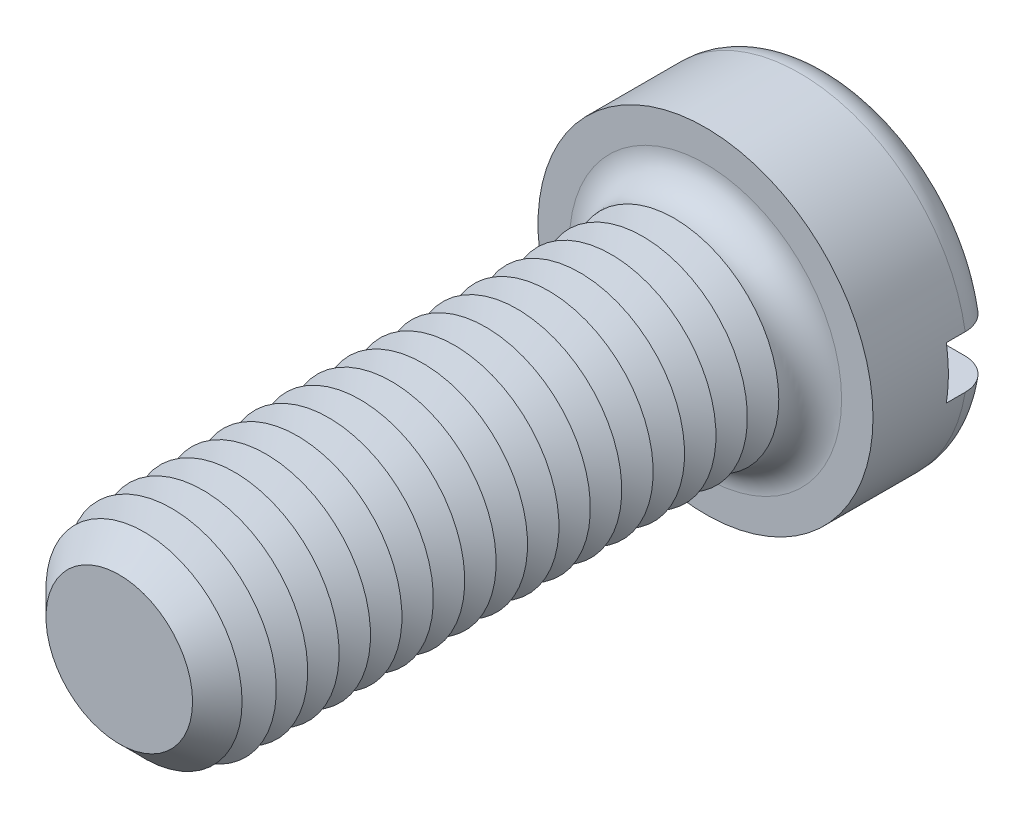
ISO-10303-21;
HEADER;
FILE_DESCRIPTION(('STEP AP214'),'2;1');
FILE_NAME('part.step','',(''),(''),'','','');
FILE_SCHEMA(('AUTOMOTIVE_DESIGN { 1 0 10303 214 1 1 1 1 }'));
ENDSEC;
DATA;
#1=APPLICATION_CONTEXT('core data for automotive mechanical design processes');
#2=APPLICATION_PROTOCOL_DEFINITION('international standard','automotive_design',2000,#1);
#3=PRODUCT_CONTEXT('',#1,'mechanical');
#4=PRODUCT('Part','Part','',(#3));
#5=PRODUCT_RELATED_PRODUCT_CATEGORY('part','',(#4));
#6=PRODUCT_DEFINITION_FORMATION('','',#4);
#7=PRODUCT_DEFINITION_CONTEXT('part definition',#1,'design');
#8=PRODUCT_DEFINITION('design','',#6,#7);
#9=PRODUCT_DEFINITION_SHAPE('','',#8);
#10=(LENGTH_UNIT() NAMED_UNIT(*) SI_UNIT(.MILLI.,.METRE.));
#11=(NAMED_UNIT(*) PLANE_ANGLE_UNIT() SI_UNIT($,.RADIAN.));
#12=(NAMED_UNIT(*) SI_UNIT($,.STERADIAN.) SOLID_ANGLE_UNIT());
#13=UNCERTAINTY_MEASURE_WITH_UNIT(LENGTH_MEASURE(1.E-05),#10,'distance_accuracy_value','');
#14=(GEOMETRIC_REPRESENTATION_CONTEXT(3) GLOBAL_UNCERTAINTY_ASSIGNED_CONTEXT((#13)) GLOBAL_UNIT_ASSIGNED_CONTEXT((#10,
#11,#12)) REPRESENTATION_CONTEXT('',''));
#15=CARTESIAN_POINT('',(0.,0.,0.));
#16=DIRECTION('',(0.,0.,1.));
#17=DIRECTION('',(1.,0.,0.));
#18=AXIS2_PLACEMENT_3D('',#15,#16,#17);
#19=CARTESIAN_POINT('',(0.,0.,-6.));
#20=DIRECTION('',(0.,0.,1.));
#21=DIRECTION('',(1.,0.,0.));
#22=AXIS2_PLACEMENT_3D('',#19,#20,#21);
#23=PLANE('',#22);
#24=CARTESIAN_POINT('',(0.,0.,-6.));
#25=DIRECTION('',(0.,0.,1.));
#26=DIRECTION('',(1.,0.,0.));
#27=AXIS2_PLACEMENT_3D('',#24,#25,#26);
#28=CIRCLE('',#27,6.5);
#29=CARTESIAN_POINT('',(-6.37867541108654,1.25,-6.));
#30=VERTEX_POINT('',#29);
#31=CARTESIAN_POINT('',(6.37867541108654,1.25,-6.));
#32=VERTEX_POINT('',#31);
#33=EDGE_CURVE('E116',#30,#32,#28,.F.);
#34=ORIENTED_EDGE('',*,*,#33,.T.);
#35=DIRECTION('',(1.,0.,0.));
#36=VECTOR('',#35,1.);
#37=CARTESIAN_POINT('',(-8.,1.25,-6.));
#38=LINE('',#37,#36);
#39=EDGE_CURVE('E111',#30,#32,#38,.T.);
#40=ORIENTED_EDGE('',*,*,#39,.F.);
#41=EDGE_LOOP('',(#34,#40));
#42=FACE_BOUND('',#41,.T.);
#43=ADVANCED_FACE('F39',(#42),#23,.F.);
#44=CARTESIAN_POINT('',(0.,0.,-4.5));
#45=DIRECTION('',(0.,0.,1.));
#46=DIRECTION('',(1.,0.,0.));
#47=AXIS2_PLACEMENT_3D('',#44,#45,#46);
#48=TOROIDAL_SURFACE('',#47,6.5,1.5);
#49=CARTESIAN_POINT('',(-7.63778128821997,1.25,-5.34492908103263));
#50=CARTESIAN_POINT('',(-7.58949199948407,1.25,-5.41482553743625));
#51=CARTESIAN_POINT('',(-7.53520056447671,1.25,-5.48065698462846));
#52=CARTESIAN_POINT('',(-7.41624971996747,1.25,-5.60228223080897));
#53=CARTESIAN_POINT('',(-7.35157642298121,1.25,-5.65806236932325));
#54=CARTESIAN_POINT('',(-7.21387612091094,1.25,-5.75795436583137));
#55=CARTESIAN_POINT('',(-7.14085828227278,1.25,-5.80207885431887));
#56=CARTESIAN_POINT('',(-6.98853766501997,1.25,-5.87758013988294));
#57=CARTESIAN_POINT('',(-6.90923642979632,1.25,-5.90896005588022));
#58=CARTESIAN_POINT('',(-6.74565677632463,1.25,-5.95849861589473));
#59=CARTESIAN_POINT('',(-6.66133328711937,1.25,-5.97650838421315));
#60=CARTESIAN_POINT('',(-6.49086565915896,1.25,-5.99833509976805));
#61=CARTESIAN_POINT('',(-6.40472129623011,1.25,-6.00215028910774));
#62=CARTESIAN_POINT('',(-6.23174891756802,1.25,-5.99550457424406));
#63=CARTESIAN_POINT('',(-6.14492874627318,1.25,-5.98483870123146));
#64=CARTESIAN_POINT('',(-5.97427268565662,1.25,-5.94920077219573));
#65=CARTESIAN_POINT('',(-5.89043699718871,1.25,-5.92422775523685));
#66=CARTESIAN_POINT('',(-5.72747580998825,1.25,-5.86041051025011));
#67=CARTESIAN_POINT('',(-5.64839123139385,1.25,-5.8214616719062));
#68=CARTESIAN_POINT('',(-5.49793182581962,1.25,-5.73076137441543));
#69=CARTESIAN_POINT('',(-5.42655700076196,1.25,-5.6790099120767));
#70=CARTESIAN_POINT('',(-5.29410028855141,1.25,-5.56444713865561));
#71=CARTESIAN_POINT('',(-5.23295591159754,1.25,-5.50170815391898));
#72=CARTESIAN_POINT('',(-5.12236155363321,1.25,-5.36664720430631));
#73=CARTESIAN_POINT('',(-5.07291010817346,1.25,-5.29432644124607));
#74=CARTESIAN_POINT('',(-4.98836421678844,1.25,-5.14389152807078));
#75=CARTESIAN_POINT('',(-4.95296843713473,1.25,-5.0659468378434));
#76=CARTESIAN_POINT('',(-4.89620356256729,1.25,-4.90510804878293));
#77=CARTESIAN_POINT('',(-4.87483169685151,1.25,-4.82221493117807));
#78=CARTESIAN_POINT('',(-4.8472995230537,1.25,-4.65636387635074));
#79=CARTESIAN_POINT('',(-4.84072446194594,1.25,-4.57347463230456));
#80=CARTESIAN_POINT('',(-4.84179430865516,1.25,-4.40779255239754));
#81=CARTESIAN_POINT('',(-4.84943782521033,1.25,-4.32499970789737));
#82=CARTESIAN_POINT('',(-4.87846819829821,1.25,-4.16301415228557));
#83=CARTESIAN_POINT('',(-4.89966978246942,1.25,-4.08378809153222));
#84=CARTESIAN_POINT('',(-4.95491528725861,1.25,-3.92995334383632));
#85=CARTESIAN_POINT('',(-4.98895983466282,1.25,-3.85534488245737));
#86=CARTESIAN_POINT('',(-5.06928242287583,1.25,-3.71183790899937));
#87=CARTESIAN_POINT('',(-5.11570495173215,1.25,-3.64302036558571));
#88=CARTESIAN_POINT('',(-5.21915370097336,1.25,-3.51388372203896));
#89=CARTESIAN_POINT('',(-5.27618132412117,1.25,-3.45356574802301));
#90=CARTESIAN_POINT('',(-5.40090076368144,1.25,-3.34137671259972));
#91=CARTESIAN_POINT('',(-5.46884305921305,1.25,-3.28978408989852));
#92=CARTESIAN_POINT('',(-5.61225757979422,1.25,-3.19841811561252));
#93=CARTESIAN_POINT('',(-5.68773079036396,1.25,-3.15864631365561));
#94=CARTESIAN_POINT('',(-5.84602026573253,1.25,-3.09111626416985));
#95=CARTESIAN_POINT('',(-5.92896901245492,1.25,-3.06366820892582));
#96=CARTESIAN_POINT('',(-6.09827849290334,1.25,-3.02294686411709));
#97=CARTESIAN_POINT('',(-6.18463944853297,1.25,-3.00967449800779));
#98=CARTESIAN_POINT('',(-6.35914138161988,1.25,-2.99765063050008));
#99=CARTESIAN_POINT('',(-6.4472913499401,1.25,-2.99902877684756));
#100=CARTESIAN_POINT('',(-6.62209547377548,1.25,-3.01665363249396));
#101=CARTESIAN_POINT('',(-6.70874965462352,1.25,-3.03290008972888));
#102=CARTESIAN_POINT('',(-6.87754008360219,1.25,-3.07975247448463));
#103=CARTESIAN_POINT('',(-6.95969991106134,1.25,-3.11027336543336));
#104=CARTESIAN_POINT('',(-7.11762200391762,1.25,-3.18486653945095));
#105=CARTESIAN_POINT('',(-7.19338469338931,1.25,-3.22893792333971));
#106=CARTESIAN_POINT('',(-7.33522754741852,1.25,-3.32873457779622));
#107=CARTESIAN_POINT('',(-7.40142768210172,1.25,-3.38428930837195));
#108=CARTESIAN_POINT('',(-7.52338344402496,1.25,-3.50587739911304));
#109=CARTESIAN_POINT('',(-7.5791399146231,1.25,-3.57190991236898));
#110=CARTESIAN_POINT('',(-7.67774856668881,1.25,-3.71151097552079));
#111=CARTESIAN_POINT('',(-7.72078137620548,1.25,-3.7849519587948));
#112=CARTESIAN_POINT('',(-7.79373860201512,1.25,-3.93807617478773));
#113=CARTESIAN_POINT('',(-7.82366445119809,1.25,-4.01775872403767));
#114=CARTESIAN_POINT('',(-7.86922494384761,1.25,-4.1801114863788));
#115=CARTESIAN_POINT('',(-7.88502105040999,1.25,-4.26273642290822));
#116=CARTESIAN_POINT('',(-7.90243332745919,1.25,-4.42948977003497));
#117=CARTESIAN_POINT('',(-7.90404643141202,1.25,-4.51361850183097));
#118=CARTESIAN_POINT('',(-7.89306914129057,1.25,-4.68049925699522));
#119=CARTESIAN_POINT('',(-7.88055163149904,1.25,-4.76325613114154));
#120=CARTESIAN_POINT('',(-7.84181179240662,1.25,-4.92542124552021));
#121=CARTESIAN_POINT('',(-7.81560657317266,1.25,-5.00483353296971));
#122=CARTESIAN_POINT('',(-7.76329893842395,1.25,-5.12766777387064));
#123=CARTESIAN_POINT('',(-7.74127773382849,1.25,-5.17287245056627));
#124=CARTESIAN_POINT('',(-7.69279783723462,1.25,-5.26083500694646));
#125=CARTESIAN_POINT('',(-7.66633917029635,1.25,-5.30359290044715));
#126=CARTESIAN_POINT('',(-7.63778128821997,1.25,-5.34492908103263));
#127=B_SPLINE_CURVE_WITH_KNOTS('',3,(#49,#50,#51,#52,#53,#54,#55,#56,#57,#58,#59,#60,#61,#62,
#63,#64,#65,#66,#67,#68,#69,#70,#71,#72,#73,#74,#75,#76,#77,#78,#79,#80,#81,#82,#83,#84,#85,#86,
#87,#88,#89,#90,#91,#92,#93,#94,#95,#96,#97,#98,#99,#100,#101,#102,#103,#104,#105,#106,#107,
#108,#109,#110,#111,#112,#113,#114,#115,#116,#117,#118,#119,#120,#121,#122,#123,#124,#125,#126),
.UNSPECIFIED.,.T.,.F.,(4,2,2,2,2,2,2,2,2,2,2,2,2,2,2,2,2,2,2,2,2,2,2,2,2,2,2,2,2,2,2,2,2,2,2,2,
2,2,4),(0.,0.254678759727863,0.509701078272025,0.764445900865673,1.01912834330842,
1.27660578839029,1.53411511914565,1.7953075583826,2.05651754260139,2.31972495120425,
2.58293242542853,2.84446831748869,3.10597143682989,3.36151874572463,3.61701554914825,
3.86525656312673,4.11347328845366,4.35836855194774,4.60327576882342,4.8511774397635,
5.0991119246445,5.35387584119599,5.60867314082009,5.86956650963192,6.13047687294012,
6.39369803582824,6.65691473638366,6.91858297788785,7.18023385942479,7.43824706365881,
7.69623942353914,7.95037087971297,8.20447454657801,8.45563599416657,8.70685174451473,
8.95677764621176,9.20639187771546,9.35700761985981,9.50762251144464),.UNSPECIFIED.);
#128=CARTESIAN_POINT('',(-7.90174031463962,1.25,-4.50000000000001));
#129=VERTEX_POINT('',#128);
#130=EDGE_CURVE('E321',#129,#30,#127,.T.);
#131=ORIENTED_EDGE('',*,*,#130,.F.);
#132=CARTESIAN_POINT('',(0.,0.,-4.5));
#133=DIRECTION('',(0.,0.,1.));
#134=DIRECTION('',(1.,0.,0.));
#135=AXIS2_PLACEMENT_3D('',#132,#133,#134);
#136=CIRCLE('',#135,8.);
#137=CARTESIAN_POINT('',(7.90174031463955,1.25,-4.5));
#138=VERTEX_POINT('',#137);
#139=EDGE_CURVE('E125',#138,#129,#136,.T.);
#140=ORIENTED_EDGE('',*,*,#139,.F.);
#141=CARTESIAN_POINT('',(4.95236709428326,1.25,-5.05808354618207));
#142=CARTESIAN_POINT('',(4.98477386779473,1.25,-5.13646278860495));
#143=CARTESIAN_POINT('',(5.02397623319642,1.25,-5.21210974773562));
#144=CARTESIAN_POINT('',(5.11464829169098,1.25,-5.35575180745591));
#145=CARTESIAN_POINT('',(5.16613670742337,1.25,-5.42373499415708));
#146=CARTESIAN_POINT('',(5.27963080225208,1.25,-5.55005899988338));
#147=CARTESIAN_POINT('',(5.34161871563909,1.25,-5.60841578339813));
#148=CARTESIAN_POINT('',(5.47431803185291,1.25,-5.71412381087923));
#149=CARTESIAN_POINT('',(5.545027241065,1.25,-5.76147781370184));
#150=CARTESIAN_POINT('',(5.69469818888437,1.25,-5.84486022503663));
#151=CARTESIAN_POINT('',(5.77379661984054,1.25,-5.88064336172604));
#152=CARTESIAN_POINT('',(5.93682776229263,1.25,-5.93863952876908));
#153=CARTESIAN_POINT('',(6.02076112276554,1.25,-5.96085073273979));
#154=CARTESIAN_POINT('',(6.19235911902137,1.25,-5.99130732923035));
#155=CARTESIAN_POINT('',(6.2800597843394,1.25,-5.99935025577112));
#156=CARTESIAN_POINT('',(6.45556807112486,1.25,-6.00057400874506));
#157=CARTESIAN_POINT('',(6.54337569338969,1.25,-5.99375472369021));
#158=CARTESIAN_POINT('',(6.71642471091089,1.25,-5.96539034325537));
#159=CARTESIAN_POINT('',(6.8016703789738,1.25,-5.94387137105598));
#160=CARTESIAN_POINT('',(6.96726399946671,1.25,-5.8866508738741));
#161=CARTESIAN_POINT('',(7.04761223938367,1.25,-5.85095018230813));
#162=CARTESIAN_POINT('',(7.2000703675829,1.25,-5.7668235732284));
#163=CARTESIAN_POINT('',(7.27226868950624,1.25,-5.71855796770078));
#164=CARTESIAN_POINT('',(7.40737382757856,1.25,-5.61041520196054));
#165=CARTESIAN_POINT('',(7.47028138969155,1.25,-5.55053897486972));
#166=CARTESIAN_POINT('',(7.5840004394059,1.25,-5.42185995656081));
#167=CARTESIAN_POINT('',(7.63498189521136,1.25,-5.35320736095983));
#168=CARTESIAN_POINT('',(7.72451646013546,1.25,-5.20822613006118));
#169=CARTESIAN_POINT('',(7.76307051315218,1.25,-5.13189807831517));
#170=CARTESIAN_POINT('',(7.82615156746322,1.25,-4.97479919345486));
#171=CARTESIAN_POINT('',(7.85085353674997,1.25,-4.89409858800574));
#172=CARTESIAN_POINT('',(7.88624162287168,1.25,-4.72968126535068));
#173=CARTESIAN_POINT('',(7.89692844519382,1.25,-4.64596470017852));
#174=CARTESIAN_POINT('',(7.90393395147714,1.25,-4.47857496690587));
#175=CARTESIAN_POINT('',(7.900361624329,1.25,-4.39490633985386));
#176=CARTESIAN_POINT('',(7.8792027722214,1.25,-4.22936201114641));
#177=CARTESIAN_POINT('',(7.86161649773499,1.25,-4.14748627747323));
#178=CARTESIAN_POINT('',(7.81298565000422,1.25,-3.98793539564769));
#179=CARTESIAN_POINT('',(7.78195585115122,1.25,-3.91025574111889));
#180=CARTESIAN_POINT('',(7.70736418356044,1.25,-3.76116938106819));
#181=CARTESIAN_POINT('',(7.66380211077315,1.25,-3.68976277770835));
#182=CARTESIAN_POINT('',(7.56515173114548,1.25,-3.55480889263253));
#183=CARTESIAN_POINT('',(7.51000119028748,1.25,-3.49130712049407));
#184=CARTESIAN_POINT('',(7.38992820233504,1.25,-3.3743390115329));
#185=CARTESIAN_POINT('',(7.32500529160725,1.25,-3.32087315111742));
#186=CARTESIAN_POINT('',(7.18646521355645,1.25,-3.22483712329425));
#187=CARTESIAN_POINT('',(7.11275872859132,1.25,-3.18239583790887));
#188=CARTESIAN_POINT('',(6.95934489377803,1.25,-3.11028530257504));
#189=CARTESIAN_POINT('',(6.87963710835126,1.25,-3.08061698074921));
#190=CARTESIAN_POINT('',(6.71523243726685,1.25,-3.03442872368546));
#191=CARTESIAN_POINT('',(6.63047940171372,1.25,-3.0181086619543));
#192=CARTESIAN_POINT('',(6.45944163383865,1.25,-2.99971307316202));
#193=CARTESIAN_POINT('',(6.37315677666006,1.25,-2.99763871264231));
#194=CARTESIAN_POINT('',(6.20021063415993,1.25,-3.00779604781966));
#195=CARTESIAN_POINT('',(6.11356117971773,1.25,-3.02022976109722));
#196=CARTESIAN_POINT('',(5.94354092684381,1.25,-3.05935975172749));
#197=CARTESIAN_POINT('',(5.86017035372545,1.25,-3.08605700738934));
#198=CARTESIAN_POINT('',(5.69848536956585,1.25,-3.15322746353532));
#199=CARTESIAN_POINT('',(5.62021039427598,1.25,-3.1937956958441));
#200=CARTESIAN_POINT('',(5.47164170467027,1.25,-3.28758816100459));
#201=CARTESIAN_POINT('',(5.40134797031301,1.25,-3.3408123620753));
#202=CARTESIAN_POINT('',(5.27136483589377,1.25,-3.45806317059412));
#203=CARTESIAN_POINT('',(5.21160120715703,1.25,-3.52200740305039));
#204=CARTESIAN_POINT('',(5.10396941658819,1.25,-3.65922833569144));
#205=CARTESIAN_POINT('',(5.05609917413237,1.25,-3.73250340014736));
#206=CARTESIAN_POINT('',(4.97487058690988,1.25,-3.8844714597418));
#207=CARTESIAN_POINT('',(4.94119529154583,1.25,-3.96299495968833));
#208=CARTESIAN_POINT('',(4.88793322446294,1.25,-4.12470694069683));
#209=CARTESIAN_POINT('',(4.86834741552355,1.25,-4.20789574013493));
#210=CARTESIAN_POINT('',(4.84433446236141,1.25,-4.3740749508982));
#211=CARTESIAN_POINT('',(4.83950391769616,1.25,-4.45700748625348));
#212=CARTESIAN_POINT('',(4.84404021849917,1.25,-4.62240731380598));
#213=CARTESIAN_POINT('',(4.85338770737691,1.25,-4.70487508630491));
#214=CARTESIAN_POINT('',(4.87895619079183,1.25,-4.83246978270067));
#215=CARTESIAN_POINT('',(4.89056704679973,1.25,-4.87856970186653));
#216=CARTESIAN_POINT('',(4.91819711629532,1.25,-4.96942661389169));
#217=CARTESIAN_POINT('',(4.93421619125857,1.25,-5.01418364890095));
#218=CARTESIAN_POINT('',(4.95236709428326,1.25,-5.05808354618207));
#219=B_SPLINE_CURVE_WITH_KNOTS('',3,(#141,#142,#143,#144,#145,#146,#147,#148,#149,#150,#151,
#152,#153,#154,#155,#156,#157,#158,#159,#160,#161,#162,#163,#164,#165,#166,#167,#168,#169,#170,
#171,#172,#173,#174,#175,#176,#177,#178,#179,#180,#181,#182,#183,#184,#185,#186,#187,#188,#189,
#190,#191,#192,#193,#194,#195,#196,#197,#198,#199,#200,#201,#202,#203,#204,#205,#206,#207,#208,
#209,#210,#211,#212,#213,#214,#215,#216,#217,#218),.UNSPECIFIED.,.T.,.F.,(4,2,2,2,2,2,2,2,2,2,2,
2,2,2,2,2,2,2,2,2,2,2,2,2,2,2,2,2,2,2,2,2,2,2,2,2,2,2,4),(0.,0.25426396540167,0.508917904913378,
0.763145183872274,1.01730864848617,1.27655188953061,1.53583000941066,1.79878406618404,
2.06174009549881,2.32423003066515,2.5867045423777,2.84598168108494,3.10523799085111,
3.36053725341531,3.61581712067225,3.8677953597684,4.11976091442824,4.36980428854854,
4.61984319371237,4.86960800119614,5.11937687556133,5.37052303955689,5.62168112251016,
5.87565515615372,6.12964764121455,6.38737709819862,6.64512765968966,6.90651052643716,
7.16791132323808,7.43114013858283,7.69436829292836,7.95565940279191,8.21690477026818,
8.47196060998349,8.72703387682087,8.97506819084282,9.22276418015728,9.36518087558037,
9.50759309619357),.UNSPECIFIED.);
#220=EDGE_CURVE('E323',#32,#138,#219,.T.);
#221=ORIENTED_EDGE('',*,*,#220,.F.);
#222=ORIENTED_EDGE('',*,*,#33,.F.);
#223=EDGE_LOOP('',(#131,#140,#221,#222));
#224=FACE_BOUND('',#223,.T.);
#225=ADVANCED_FACE('F305',(#224),#48,.T.);
#226=CARTESIAN_POINT('',(0.,0.,-6.));
#227=DIRECTION('',(0.,0.,1.));
#228=DIRECTION('',(1.,0.,0.));
#229=AXIS2_PLACEMENT_3D('',#226,#227,#228);
#230=CYLINDRICAL_SURFACE('',#229,8.);
#231=DIRECTION('',(0.,0.,1.));
#232=VECTOR('',#231,1.);
#233=CARTESIAN_POINT('',(7.90174031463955,1.25,-6.));
#234=LINE('',#233,#232);
#235=CARTESIAN_POINT('',(7.90174031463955,1.25,-3.6));
#236=VERTEX_POINT('',#235);
#237=EDGE_CURVE('E338',#138,#236,#234,.T.);
#238=ORIENTED_EDGE('',*,*,#237,.F.);
#239=ORIENTED_EDGE('',*,*,#139,.T.);
#240=DIRECTION('',(0.,0.,1.));
#241=VECTOR('',#240,1.);
#242=CARTESIAN_POINT('',(-7.90174031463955,1.25,-6.));
#243=LINE('',#242,#241);
#244=CARTESIAN_POINT('',(-7.90174031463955,1.25,-3.6));
#245=VERTEX_POINT('',#244);
#246=EDGE_CURVE('E63',#245,#129,#243,.F.);
#247=ORIENTED_EDGE('',*,*,#246,.F.);
#248=CARTESIAN_POINT('',(0.,0.,-3.6));
#249=DIRECTION('',(0.,0.,-1.));
#250=DIRECTION('',(-1.,0.,0.));
#251=AXIS2_PLACEMENT_3D('',#248,#249,#250);
#252=CIRCLE('',#251,8.);
#253=CARTESIAN_POINT('',(-7.90174031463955,-1.25,-3.6));
#254=VERTEX_POINT('',#253);
#255=EDGE_CURVE('E43',#245,#254,#252,.F.);
#256=ORIENTED_EDGE('',*,*,#255,.T.);
#257=DIRECTION('',(0.,0.,1.));
#258=VECTOR('',#257,1.);
#259=CARTESIAN_POINT('',(-7.90174031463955,-1.25,-6.));
#260=LINE('',#259,#258);
#261=CARTESIAN_POINT('',(-7.9017403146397,-1.25,-4.49999999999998));
#262=VERTEX_POINT('',#261);
#263=EDGE_CURVE('E335',#262,#254,#260,.T.);
#264=ORIENTED_EDGE('',*,*,#263,.F.);
#265=CARTESIAN_POINT('',(7.90174031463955,-1.25,-4.5));
#266=VERTEX_POINT('',#265);
#267=EDGE_CURVE('E127',#262,#266,#136,.T.);
#268=ORIENTED_EDGE('',*,*,#267,.T.);
#269=DIRECTION('',(0.,0.,1.));
#270=VECTOR('',#269,1.);
#271=CARTESIAN_POINT('',(7.90174031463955,-1.25,-6.));
#272=LINE('',#271,#270);
#273=CARTESIAN_POINT('',(7.90174031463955,-1.25,-3.6));
#274=VERTEX_POINT('',#273);
#275=EDGE_CURVE('E55',#274,#266,#272,.F.);
#276=ORIENTED_EDGE('',*,*,#275,.F.);
#277=EDGE_CURVE('E11',#274,#236,#252,.F.);
#278=ORIENTED_EDGE('',*,*,#277,.T.);
#279=EDGE_LOOP('',(#238,#239,#247,#256,#264,#268,#276,#278));
#280=FACE_BOUND('',#279,.T.);
#281=CARTESIAN_POINT('',(0.,0.,0.));
#282=DIRECTION('',(0.,0.,1.));
#283=DIRECTION('',(1.,0.,0.));
#284=AXIS2_PLACEMENT_3D('',#281,#282,#283);
#285=CIRCLE('',#284,8.);
#286=CARTESIAN_POINT('',(8.,0.,0.));
#287=VERTEX_POINT('',#286);
#288=EDGE_CURVE('E340',#287,#287,#285,.T.);
#289=ORIENTED_EDGE('',*,*,#288,.F.);
#290=EDGE_LOOP('',(#289));
#291=FACE_BOUND('',#290,.T.);
#292=ADVANCED_FACE('F301',(#280,#291),#230,.T.);
#293=CARTESIAN_POINT('',(6.37867541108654,-1.25,-6.));
#294=VERTEX_POINT('',#293);
#295=CARTESIAN_POINT('',(-6.37867541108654,-1.25,-6.));
#296=VERTEX_POINT('',#295);
#297=EDGE_CURVE('E109',#294,#296,#28,.F.);
#298=ORIENTED_EDGE('',*,*,#297,.T.);
#299=DIRECTION('',(-1.,0.,0.));
#300=VECTOR('',#299,1.);
#301=CARTESIAN_POINT('',(-8.,-1.25,-6.));
#302=LINE('',#301,#300);
#303=EDGE_CURVE('E96',#294,#296,#302,.T.);
#304=ORIENTED_EDGE('',*,*,#303,.F.);
#305=EDGE_LOOP('',(#298,#304));
#306=FACE_BOUND('',#305,.T.);
#307=ADVANCED_FACE('F108',(#306),#23,.F.);
#308=CARTESIAN_POINT('',(0.,0.,0.));
#309=DIRECTION('',(0.,0.,1.));
#310=DIRECTION('',(1.,0.,0.));
#311=AXIS2_PLACEMENT_3D('',#308,#309,#310);
#312=PLANE('',#311);
#313=CARTESIAN_POINT('',(0.,0.,0.));
#314=DIRECTION('',(0.,0.,1.));
#315=DIRECTION('',(1.,0.,0.));
#316=AXIS2_PLACEMENT_3D('',#313,#314,#315);
#317=CIRCLE('',#316,6.5);
#318=CARTESIAN_POINT('',(6.5,0.,0.));
#319=VERTEX_POINT('',#318);
#320=EDGE_CURVE('E115',#319,#319,#317,.F.);
#321=ORIENTED_EDGE('',*,*,#320,.T.);
#322=EDGE_LOOP('',(#321));
#323=FACE_BOUND('',#322,.T.);
#324=ORIENTED_EDGE('',*,*,#288,.T.);
#325=EDGE_LOOP('',(#324));
#326=FACE_BOUND('',#325,.T.);
#327=ADVANCED_FACE('F300',(#323,#326),#312,.T.);
#328=CARTESIAN_POINT('',(-7.63778128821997,-1.25,-5.34492908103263));
#329=CARTESIAN_POINT('',(-7.68527581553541,-1.25,-5.27616964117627));
#330=CARTESIAN_POINT('',(-7.72703224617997,-1.25,-5.20337764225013));
#331=CARTESIAN_POINT('',(-7.79778035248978,-1.25,-5.05176511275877));
#332=CARTESIAN_POINT('',(-7.82675823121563,-1.25,-4.97293817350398));
#333=CARTESIAN_POINT('',(-7.87103239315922,-1.25,-4.81153865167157));
#334=CARTESIAN_POINT('',(-7.8863313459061,-1.25,-4.72896680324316));
#335=CARTESIAN_POINT('',(-7.90278562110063,-1.25,-4.56244566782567));
#336=CARTESIAN_POINT('',(-7.90394420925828,-1.25,-4.4784967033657));
#337=CARTESIAN_POINT('',(-7.89211470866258,-1.25,-4.31190980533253));
#338=CARTESIAN_POINT('',(-7.87917806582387,-1.25,-4.22926821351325));
#339=CARTESIAN_POINT('',(-7.8396278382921,-1.25,-4.06732477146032));
#340=CARTESIAN_POINT('',(-7.81301388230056,-1.25,-3.98802301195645));
#341=CARTESIAN_POINT('',(-7.74686575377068,-1.25,-3.83490116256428));
#342=CARTESIAN_POINT('',(-7.70731700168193,-1.25,-3.76108737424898));
#343=CARTESIAN_POINT('',(-7.61647675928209,-1.25,-3.62108231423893));
#344=CARTESIAN_POINT('',(-7.56518496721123,-1.25,-3.55489123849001));
#345=CARTESIAN_POINT('',(-7.45192141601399,-1.25,-3.43145488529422));
#346=CARTESIAN_POINT('',(-7.3898717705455,-1.25,-3.37428109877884));
#347=CARTESIAN_POINT('',(-7.25715883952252,-1.25,-3.27100737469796));
#348=CARTESIAN_POINT('',(-7.18649507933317,-1.25,-3.22490804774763));
#349=CARTESIAN_POINT('',(-7.03760898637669,-1.25,-3.14445316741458));
#350=CARTESIAN_POINT('',(-6.95930204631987,-1.25,-3.1102542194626));
#351=CARTESIAN_POINT('',(-6.79811453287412,-1.25,-3.05526915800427));
#352=CARTESIAN_POINT('',(-6.71523359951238,-1.25,-3.03448410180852));
#353=CARTESIAN_POINT('',(-6.5459165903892,-1.25,-3.006592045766));
#354=CARTESIAN_POINT('',(-6.45944575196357,-1.25,-2.99969602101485));
#355=CARTESIAN_POINT('',(-6.28655568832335,-1.25,-3.00032465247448));
#356=CARTESIAN_POINT('',(-6.20013646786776,-1.25,-3.00785047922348));
#357=CARTESIAN_POINT('',(-6.02865505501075,-1.25,-3.03725742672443));
#358=CARTESIAN_POINT('',(-5.94362352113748,-1.25,-3.05931758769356));
#359=CARTESIAN_POINT('',(-5.77844448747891,-1.25,-3.11735373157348));
#360=CARTESIAN_POINT('',(-5.69829723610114,-1.25,-3.15333042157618));
#361=CARTESIAN_POINT('',(-5.54495924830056,-1.25,-3.23837037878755));
#362=CARTESIAN_POINT('',(-5.47178958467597,-1.25,-3.28747168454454));
#363=CARTESIAN_POINT('',(-5.33486536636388,-1.25,-3.39741183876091));
#364=CARTESIAN_POINT('',(-5.27111040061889,-1.25,-3.45825017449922));
#365=CARTESIAN_POINT('',(-5.15579778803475,-1.25,-3.58914722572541));
#366=CARTESIAN_POINT('',(-5.10409113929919,-1.25,-3.65907455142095));
#367=CARTESIAN_POINT('',(-5.01353659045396,-1.25,-3.8068142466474));
#368=CARTESIAN_POINT('',(-4.97468647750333,-1.25,-3.88462525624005));
#369=CARTESIAN_POINT('',(-4.91208858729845,-1.25,-4.04366636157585));
#370=CARTESIAN_POINT('',(-4.88795969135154,-1.25,-4.12474643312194));
#371=CARTESIAN_POINT('',(-4.85404909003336,-1.25,-4.28985038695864));
#372=CARTESIAN_POINT('',(-4.84426486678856,-1.25,-4.37387374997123));
#373=CARTESIAN_POINT('',(-4.83946276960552,-1.25,-4.54023897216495));
#374=CARTESIAN_POINT('',(-4.8440833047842,-1.25,-4.62257060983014));
#375=CARTESIAN_POINT('',(-4.86713763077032,-1.25,-4.78527148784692));
#376=CARTESIAN_POINT('',(-4.88557092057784,-1.25,-4.86564079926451));
#377=CARTESIAN_POINT('',(-4.9355229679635,-1.25,-5.02189555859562));
#378=CARTESIAN_POINT('',(-4.9669975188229,-1.25,-5.09779517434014));
#379=CARTESIAN_POINT('',(-5.04199393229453,-1.25,-5.24338322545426));
#380=CARTESIAN_POINT('',(-5.0855168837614,-1.25,-5.31307109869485));
#381=CARTESIAN_POINT('',(-5.18427540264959,-1.25,-5.44580979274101));
#382=CARTESIAN_POINT('',(-5.2397318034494,-1.25,-5.50869620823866));
#383=CARTESIAN_POINT('',(-5.36015301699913,-1.25,-5.62458635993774));
#384=CARTESIAN_POINT('',(-5.42511919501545,-1.25,-5.67758867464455));
#385=CARTESIAN_POINT('',(-5.56469412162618,-1.25,-5.7737610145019));
#386=CARTESIAN_POINT('',(-5.6395232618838,-1.25,-5.81661133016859));
#387=CARTESIAN_POINT('',(-5.79521544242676,-1.25,-5.8894110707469));
#388=CARTESIAN_POINT('',(-5.8760791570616,-1.25,-5.91935905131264));
#389=CARTESIAN_POINT('',(-6.04317815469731,-1.25,-5.9660059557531));
#390=CARTESIAN_POINT('',(-6.12948555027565,-1.25,-5.98244700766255));
#391=CARTESIAN_POINT('',(-6.30363462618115,-1.25,-6.00064866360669));
#392=CARTESIAN_POINT('',(-6.39147629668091,-1.25,-6.00240936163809));
#393=CARTESIAN_POINT('',(-6.5664192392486,-1.25,-5.9911248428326));
#394=CARTESIAN_POINT('',(-6.653518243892,-1.25,-5.9780442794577));
#395=CARTESIAN_POINT('',(-6.82426167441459,-1.25,-5.93729204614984));
#396=CARTESIAN_POINT('',(-6.90790538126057,-1.25,-5.90961735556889));
#397=CARTESIAN_POINT('',(-7.06846412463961,-1.25,-5.84071272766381));
#398=CARTESIAN_POINT('',(-7.14543542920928,-1.25,-5.79961377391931));
#399=CARTESIAN_POINT('',(-7.29116896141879,-1.25,-5.70491210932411));
#400=CARTESIAN_POINT('',(-7.35994165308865,-1.25,-5.65132560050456));
#401=CARTESIAN_POINT('',(-7.46362894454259,-1.25,-5.55509815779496));
#402=CARTESIAN_POINT('',(-7.50165191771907,-1.25,-5.51575032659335));
#403=CARTESIAN_POINT('',(-7.57319530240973,-1.25,-5.43315308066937));
#404=CARTESIAN_POINT('',(-7.60671575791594,-1.25,-5.38990370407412));
#405=CARTESIAN_POINT('',(-7.63778128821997,-1.25,-5.34492908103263));
#406=B_SPLINE_CURVE_WITH_KNOTS('',3,(#328,#329,#330,#331,#332,#333,#334,#335,#336,#337,#338,
#339,#340,#341,#342,#343,#344,#345,#346,#347,#348,#349,#350,#351,#352,#353,#354,#355,#356,#357,
#358,#359,#360,#361,#362,#363,#364,#365,#366,#367,#368,#369,#370,#371,#372,#373,#374,#375,#376,
#377,#378,#379,#380,#381,#382,#383,#384,#385,#386,#387,#388,#389,#390,#391,#392,#393,#394,#395,
#396,#397,#398,#399,#400,#401,#402,#403,#404,#405),.UNSPECIFIED.,.T.,.F.,(4,2,2,2,2,2,2,2,2,2,2,
2,2,2,2,2,2,2,2,2,2,2,2,2,2,2,2,2,2,2,2,2,2,2,2,2,2,2,4),(0.,0.250506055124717,
0.501281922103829,0.752008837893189,1.00267784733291,1.25243500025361,1.50219893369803,
1.75224536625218,2.00229822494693,2.25424343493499,2.50620253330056,2.76136198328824,
3.01654154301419,3.27556891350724,3.53461730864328,3.79691797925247,4.05923197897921,
4.32231463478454,4.5853858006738,4.84500678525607,5.10458306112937,5.3571172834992,
5.60960717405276,5.85581050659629,6.10200490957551,6.34737151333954,6.59276029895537,
6.84315522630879,7.09358613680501,7.35108485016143,7.60861238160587,7.87094926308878,
8.13328446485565,8.39624576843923,8.65926152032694,8.91978401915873,9.17997036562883,
9.34382460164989,9.50767723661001),.UNSPECIFIED.);
#407=EDGE_CURVE('E103',#296,#262,#406,.T.);
#408=ORIENTED_EDGE('',*,*,#407,.F.);
#409=ORIENTED_EDGE('',*,*,#297,.F.);
#410=CARTESIAN_POINT('',(4.95236709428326,-1.25,-5.05808354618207));
#411=CARTESIAN_POINT('',(4.92105512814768,-1.25,-4.98233216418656));
#412=CARTESIAN_POINT('',(4.89604361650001,-1.25,-4.90392040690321));
#413=CARTESIAN_POINT('',(4.85951223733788,-1.25,-4.74395758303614));
#414=CARTESIAN_POINT('',(4.8480045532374,-1.25,-4.66240375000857));
#415=CARTESIAN_POINT('',(4.83891469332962,-1.25,-4.49852199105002));
#416=CARTESIAN_POINT('',(4.84133145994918,-1.25,-4.41619412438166));
#417=CARTESIAN_POINT('',(4.8600038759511,-1.25,-4.25314313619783));
#418=CARTESIAN_POINT('',(4.87625705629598,-1.25,-4.17241973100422));
#419=CARTESIAN_POINT('',(4.92196554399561,-1.25,-4.01505032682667));
#420=CARTESIAN_POINT('',(4.95138456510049,-1.25,-3.93839376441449));
#421=CARTESIAN_POINT('',(5.02244158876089,-1.25,-3.79097367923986));
#422=CARTESIAN_POINT('',(5.06408092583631,-1.25,-3.72021080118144));
#423=CARTESIAN_POINT('',(5.15918188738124,-1.25,-3.5851203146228));
#424=CARTESIAN_POINT('',(5.21285223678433,-1.25,-3.5209397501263));
#425=CARTESIAN_POINT('',(5.32993512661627,-1.25,-3.40218700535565));
#426=CARTESIAN_POINT('',(5.39334903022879,-1.25,-3.34761617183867));
#427=CARTESIAN_POINT('',(5.5300552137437,-1.25,-3.24801679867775));
#428=CARTESIAN_POINT('',(5.60357647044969,-1.25,-3.20330242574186));
#429=CARTESIAN_POINT('',(5.75697062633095,-1.25,-3.1265687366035));
#430=CARTESIAN_POINT('',(5.83684424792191,-1.25,-3.09455086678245));
#431=CARTESIAN_POINT('',(6.00239031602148,-1.25,-3.04353393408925));
#432=CARTESIAN_POINT('',(6.08814636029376,-1.25,-3.02480570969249));
#433=CARTESIAN_POINT('',(6.26158564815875,-1.25,-3.00194915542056));
#434=CARTESIAN_POINT('',(6.34926896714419,-1.25,-2.997821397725));
#435=CARTESIAN_POINT('',(6.52441816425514,-1.25,-3.00435236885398));
#436=CARTESIAN_POINT('',(6.61188199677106,-1.25,-3.01506655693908));
#437=CARTESIAN_POINT('',(6.78373130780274,-1.25,-3.05116556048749));
#438=CARTESIAN_POINT('',(6.8681168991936,-1.25,-3.07654983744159));
#439=CARTESIAN_POINT('',(7.03056473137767,-1.25,-3.14105639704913));
#440=CARTESIAN_POINT('',(7.10867812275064,-1.25,-3.18004978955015));
#441=CARTESIAN_POINT('',(7.25711285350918,-1.25,-3.27078804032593));
#442=CARTESIAN_POINT('',(7.327434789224,-1.25,-3.32253192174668));
#443=CARTESIAN_POINT('',(7.45716954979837,-1.25,-3.4364775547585));
#444=CARTESIAN_POINT('',(7.51672925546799,-1.25,-3.49851206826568));
#445=CARTESIAN_POINT('',(7.62440498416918,-1.25,-3.63182557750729));
#446=CARTESIAN_POINT('',(7.67252193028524,-1.25,-3.70310382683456));
#447=CARTESIAN_POINT('',(7.75523498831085,-1.25,-3.8517825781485));
#448=CARTESIAN_POINT('',(7.79001407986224,-1.25,-3.92908131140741));
#449=CARTESIAN_POINT('',(7.84595474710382,-1.25,-4.08845836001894));
#450=CARTESIAN_POINT('',(7.86711715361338,-1.25,-4.1705363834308));
#451=CARTESIAN_POINT('',(7.89503817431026,-1.25,-4.3362768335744));
#452=CARTESIAN_POINT('',(7.90193595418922,-1.25,-4.41991584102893));
#453=CARTESIAN_POINT('',(7.90153623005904,-1.25,-4.58715860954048));
#454=CARTESIAN_POINT('',(7.89423915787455,-1.25,-4.67076237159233));
#455=CARTESIAN_POINT('',(7.86572271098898,-1.25,-4.83525080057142));
#456=CARTESIAN_POINT('',(7.84455307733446,-1.25,-4.91614410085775));
#457=CARTESIAN_POINT('',(7.78897430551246,-1.25,-5.0732444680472));
#458=CARTESIAN_POINT('',(7.75456511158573,-1.25,-5.1494515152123));
#459=CARTESIAN_POINT('',(7.67339923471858,-1.25,-5.29528903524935));
#460=CARTESIAN_POINT('',(7.62660424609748,-1.25,-5.36489817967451));
#461=CARTESIAN_POINT('',(7.52209201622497,-1.25,-5.49536318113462));
#462=CARTESIAN_POINT('',(7.4643743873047,-1.25,-5.55621872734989));
#463=CARTESIAN_POINT('',(7.33909994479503,-1.25,-5.66807257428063));
#464=CARTESIAN_POINT('',(7.27145672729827,-1.25,-5.71897407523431));
#465=CARTESIAN_POINT('',(7.12868060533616,-1.25,-5.80887807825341));
#466=CARTESIAN_POINT('',(7.0535472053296,-1.25,-5.84787979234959));
#467=CARTESIAN_POINT('',(6.89682225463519,-1.25,-5.91345911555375));
#468=CARTESIAN_POINT('',(6.81515596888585,-1.25,-5.93985808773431));
#469=CARTESIAN_POINT('',(6.64858434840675,-1.25,-5.97879449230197));
#470=CARTESIAN_POINT('',(6.56367874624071,-1.25,-5.99133077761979));
#471=CARTESIAN_POINT('',(6.39168259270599,-1.25,-6.00236627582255));
#472=CARTESIAN_POINT('',(6.30457835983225,-1.25,-6.00065255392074));
#473=CARTESIAN_POINT('',(6.13186422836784,-1.25,-5.98278857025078));
#474=CARTESIAN_POINT('',(6.04625438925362,-1.25,-5.96663773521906));
#475=CARTESIAN_POINT('',(5.87802521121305,-1.25,-5.92012173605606));
#476=CARTESIAN_POINT('',(5.79544617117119,-1.25,-5.88961066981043));
#477=CARTESIAN_POINT('',(5.63656223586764,-1.25,-5.81513349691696));
#478=CARTESIAN_POINT('',(5.56025908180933,-1.25,-5.77116367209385));
#479=CARTESIAN_POINT('',(5.4162607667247,-1.25,-5.67098882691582));
#480=CARTESIAN_POINT('',(5.34855795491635,-1.25,-5.61479480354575));
#481=CARTESIAN_POINT('',(5.22382615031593,-1.25,-5.49168804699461));
#482=CARTESIAN_POINT('',(5.16678340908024,-1.25,-5.42478932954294));
#483=CARTESIAN_POINT('',(5.08326589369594,-1.25,-5.3075481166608));
#484=CARTESIAN_POINT('',(5.05313168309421,-1.25,-5.25976959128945));
#485=CARTESIAN_POINT('',(4.99845900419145,-1.25,-5.16110869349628));
#486=CARTESIAN_POINT('',(4.9739204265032,-1.25,-5.11022638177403));
#487=CARTESIAN_POINT('',(4.95236709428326,-1.25,-5.05808354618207));
#488=B_SPLINE_CURVE_WITH_KNOTS('',3,(#410,#411,#412,#413,#414,#415,#416,#417,#418,#419,#420,
#421,#422,#423,#424,#425,#426,#427,#428,#429,#430,#431,#432,#433,#434,#435,#436,#437,#438,#439,
#440,#441,#442,#443,#444,#445,#446,#447,#448,#449,#450,#451,#452,#453,#454,#455,#456,#457,#458,
#459,#460,#461,#462,#463,#464,#465,#466,#467,#468,#469,#470,#471,#472,#473,#474,#475,#476,#477,
#478,#479,#480,#481,#482,#483,#484,#485,#486,#487),.UNSPECIFIED.,.T.,.F.,(4,2,2,2,2,2,2,2,2,2,2,
2,2,2,2,2,2,2,2,2,2,2,2,2,2,2,2,2,2,2,2,2,2,2,2,2,2,2,4),(0.,0.245701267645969,
0.491624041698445,0.737528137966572,0.983388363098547,1.22857510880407,1.47378864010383,
1.72364048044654,1.97352730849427,2.2304941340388,2.48749022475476,2.74958408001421,
3.01168820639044,3.2747743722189,3.53785088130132,3.79850056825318,4.05913029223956,
4.31587819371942,4.57260537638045,4.82567253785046,5.07872425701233,5.32929532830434,
5.57985877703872,5.82952869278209,6.07919966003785,6.32965199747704,6.58011322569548,
6.8329006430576,7.08570479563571,7.3419930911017,7.59830259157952,7.85844887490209,
8.11860548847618,8.38146435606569,8.64439590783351,8.90709189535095,9.16944670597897,
9.33857644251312,9.5077028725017),.UNSPECIFIED.);
#489=EDGE_CURVE('E92',#266,#294,#488,.T.);
#490=ORIENTED_EDGE('',*,*,#489,.F.);
#491=ORIENTED_EDGE('',*,*,#267,.F.);
#492=EDGE_LOOP('',(#408,#409,#490,#491));
#493=FACE_BOUND('',#492,.T.);
#494=ADVANCED_FACE('F113',(#493),#48,.T.);
#495=CARTESIAN_POINT('',(0.,0.,1.5));
#496=DIRECTION('',(0.,0.,1.));
#497=DIRECTION('',(1.,0.,0.));
#498=AXIS2_PLACEMENT_3D('',#495,#496,#497);
#499=TOROIDAL_SURFACE('',#498,6.5,1.5);
#500=ORIENTED_EDGE('',*,*,#320,.F.);
#501=EDGE_LOOP('',(#500));
#502=FACE_BOUND('',#501,.T.);
#503=CARTESIAN_POINT('',(0.,0.,1.5));
#504=DIRECTION('',(0.,0.,-1.));
#505=DIRECTION('',(-1.,0.,0.));
#506=AXIS2_PLACEMENT_3D('',#503,#504,#505);
#507=CIRCLE('',#506,5.);
#508=CARTESIAN_POINT('',(-5.,0.,1.5));
#509=VERTEX_POINT('',#508);
#510=EDGE_CURVE('E345',#509,#509,#507,.T.);
#511=ORIENTED_EDGE('',*,*,#510,.T.);
#512=EDGE_LOOP('',(#511));
#513=FACE_BOUND('',#512,.T.);
#514=ADVANCED_FACE('F293',(#502,#513),#499,.F.);
#515=CARTESIAN_POINT('',(0.,0.,2.25));
#516=DIRECTION('',(0.,0.,-1.));
#517=DIRECTION('',(-1.,0.,0.));
#518=AXIS2_PLACEMENT_3D('',#515,#516,#517);
#519=CONICAL_SURFACE('',#518,3.70096189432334,1.0471975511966);
#520=ORIENTED_EDGE('',*,*,#510,.F.);
#521=EDGE_LOOP('',(#520));
#522=FACE_BOUND('',#521,.T.);
#523=CARTESIAN_POINT('',(0.,0.,2.25));
#524=DIRECTION('',(0.,0.,-1.));
#525=DIRECTION('',(-1.,0.,0.));
#526=AXIS2_PLACEMENT_3D('',#523,#524,#525);
#527=CIRCLE('',#526,3.70096189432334);
#528=CARTESIAN_POINT('',(-3.70096189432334,0.,2.25));
#529=VERTEX_POINT('',#528);
#530=EDGE_CURVE('E350',#529,#529,#527,.T.);
#531=ORIENTED_EDGE('',*,*,#530,.T.);
#532=EDGE_LOOP('',(#531));
#533=FACE_BOUND('',#532,.T.);
#534=ADVANCED_FACE('F289',(#522,#533),#519,.T.);
#535=CARTESIAN_POINT('',(0.,0.,3.));
#536=DIRECTION('',(0.,0.,1.));
#537=DIRECTION('',(1.,0.,0.));
#538=AXIS2_PLACEMENT_3D('',#535,#536,#537);
#539=CONICAL_SURFACE('',#538,5.,1.0471975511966);
#540=ORIENTED_EDGE('',*,*,#530,.F.);
#541=EDGE_LOOP('',(#540));
#542=FACE_BOUND('',#541,.T.);
#543=CARTESIAN_POINT('',(0.,0.,3.));
#544=DIRECTION('',(0.,0.,-1.));
#545=DIRECTION('',(-1.,0.,0.));
#546=AXIS2_PLACEMENT_3D('',#543,#544,#545);
#547=CIRCLE('',#546,5.);
#548=CARTESIAN_POINT('',(-5.,0.,3.));
#549=VERTEX_POINT('',#548);
#550=EDGE_CURVE('E356',#549,#549,#547,.T.);
#551=ORIENTED_EDGE('',*,*,#550,.T.);
#552=EDGE_LOOP('',(#551));
#553=FACE_BOUND('',#552,.T.);
#554=ADVANCED_FACE('F285',(#542,#553),#539,.T.);
#555=CARTESIAN_POINT('',(0.,0.,3.75));
#556=DIRECTION('',(0.,0.,-1.));
#557=DIRECTION('',(-1.,0.,0.));
#558=AXIS2_PLACEMENT_3D('',#555,#556,#557);
#559=CONICAL_SURFACE('',#558,3.70096189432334,1.0471975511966);
#560=ORIENTED_EDGE('',*,*,#550,.F.);
#561=EDGE_LOOP('',(#560));
#562=FACE_BOUND('',#561,.T.);
#563=CARTESIAN_POINT('',(0.,0.,3.75));
#564=DIRECTION('',(0.,0.,-1.));
#565=DIRECTION('',(-1.,0.,0.));
#566=AXIS2_PLACEMENT_3D('',#563,#564,#565);
#567=CIRCLE('',#566,3.70096189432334);
#568=CARTESIAN_POINT('',(-3.70096189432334,0.,3.75));
#569=VERTEX_POINT('',#568);
#570=EDGE_CURVE('E359',#569,#569,#567,.T.);
#571=ORIENTED_EDGE('',*,*,#570,.T.);
#572=EDGE_LOOP('',(#571));
#573=FACE_BOUND('',#572,.T.);
#574=ADVANCED_FACE('F281',(#562,#573),#559,.T.);
#575=CARTESIAN_POINT('',(0.,0.,4.5));
#576=DIRECTION('',(0.,0.,1.));
#577=DIRECTION('',(1.,0.,0.));
#578=AXIS2_PLACEMENT_3D('',#575,#576,#577);
#579=CONICAL_SURFACE('',#578,5.,1.0471975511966);
#580=ORIENTED_EDGE('',*,*,#570,.F.);
#581=EDGE_LOOP('',(#580));
#582=FACE_BOUND('',#581,.T.);
#583=CARTESIAN_POINT('',(0.,0.,4.5));
#584=DIRECTION('',(0.,0.,-1.));
#585=DIRECTION('',(-1.,0.,0.));
#586=AXIS2_PLACEMENT_3D('',#583,#584,#585);
#587=CIRCLE('',#586,5.);
#588=CARTESIAN_POINT('',(-5.,0.,4.5));
#589=VERTEX_POINT('',#588);
#590=EDGE_CURVE('E363',#589,#589,#587,.T.);
#591=ORIENTED_EDGE('',*,*,#590,.T.);
#592=EDGE_LOOP('',(#591));
#593=FACE_BOUND('',#592,.T.);
#594=ADVANCED_FACE('F277',(#582,#593),#579,.T.);
#595=CARTESIAN_POINT('',(0.,0.,5.25));
#596=DIRECTION('',(0.,0.,-1.));
#597=DIRECTION('',(-1.,0.,0.));
#598=AXIS2_PLACEMENT_3D('',#595,#596,#597);
#599=CONICAL_SURFACE('',#598,3.70096189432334,1.0471975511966);
#600=ORIENTED_EDGE('',*,*,#590,.F.);
#601=EDGE_LOOP('',(#600));
#602=FACE_BOUND('',#601,.T.);
#603=CARTESIAN_POINT('',(0.,0.,5.25));
#604=DIRECTION('',(0.,0.,-1.));
#605=DIRECTION('',(-1.,0.,0.));
#606=AXIS2_PLACEMENT_3D('',#603,#604,#605);
#607=CIRCLE('',#606,3.70096189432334);
#608=CARTESIAN_POINT('',(-3.70096189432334,0.,5.25));
#609=VERTEX_POINT('',#608);
#610=EDGE_CURVE('E367',#609,#609,#607,.T.);
#611=ORIENTED_EDGE('',*,*,#610,.T.);
#612=EDGE_LOOP('',(#611));
#613=FACE_BOUND('',#612,.T.);
#614=ADVANCED_FACE('F273',(#602,#613),#599,.T.);
#615=CARTESIAN_POINT('',(0.,0.,6.));
#616=DIRECTION('',(0.,0.,1.));
#617=DIRECTION('',(1.,0.,0.));
#618=AXIS2_PLACEMENT_3D('',#615,#616,#617);
#619=CONICAL_SURFACE('',#618,5.,1.0471975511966);
#620=ORIENTED_EDGE('',*,*,#610,.F.);
#621=EDGE_LOOP('',(#620));
#622=FACE_BOUND('',#621,.T.);
#623=CARTESIAN_POINT('',(0.,0.,6.));
#624=DIRECTION('',(0.,0.,-1.));
#625=DIRECTION('',(-1.,0.,0.));
#626=AXIS2_PLACEMENT_3D('',#623,#624,#625);
#627=CIRCLE('',#626,5.);
#628=CARTESIAN_POINT('',(-5.,0.,6.));
#629=VERTEX_POINT('',#628);
#630=EDGE_CURVE('E371',#629,#629,#627,.T.);
#631=ORIENTED_EDGE('',*,*,#630,.T.);
#632=EDGE_LOOP('',(#631));
#633=FACE_BOUND('',#632,.T.);
#634=ADVANCED_FACE('F269',(#622,#633),#619,.T.);
#635=CARTESIAN_POINT('',(0.,0.,6.75));
#636=DIRECTION('',(0.,0.,-1.));
#637=DIRECTION('',(-1.,0.,0.));
#638=AXIS2_PLACEMENT_3D('',#635,#636,#637);
#639=CONICAL_SURFACE('',#638,3.70096189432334,1.0471975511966);
#640=ORIENTED_EDGE('',*,*,#630,.F.);
#641=EDGE_LOOP('',(#640));
#642=FACE_BOUND('',#641,.T.);
#643=CARTESIAN_POINT('',(0.,0.,6.75));
#644=DIRECTION('',(0.,0.,-1.));
#645=DIRECTION('',(-1.,0.,0.));
#646=AXIS2_PLACEMENT_3D('',#643,#644,#645);
#647=CIRCLE('',#646,3.70096189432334);
#648=CARTESIAN_POINT('',(-3.70096189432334,0.,6.75));
#649=VERTEX_POINT('',#648);
#650=EDGE_CURVE('E375',#649,#649,#647,.T.);
#651=ORIENTED_EDGE('',*,*,#650,.T.);
#652=EDGE_LOOP('',(#651));
#653=FACE_BOUND('',#652,.T.);
#654=ADVANCED_FACE('F265',(#642,#653),#639,.T.);
#655=CARTESIAN_POINT('',(0.,0.,7.5));
#656=DIRECTION('',(0.,0.,1.));
#657=DIRECTION('',(1.,0.,0.));
#658=AXIS2_PLACEMENT_3D('',#655,#656,#657);
#659=CONICAL_SURFACE('',#658,5.,1.0471975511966);
#660=ORIENTED_EDGE('',*,*,#650,.F.);
#661=EDGE_LOOP('',(#660));
#662=FACE_BOUND('',#661,.T.);
#663=CARTESIAN_POINT('',(0.,0.,7.5));
#664=DIRECTION('',(0.,0.,-1.));
#665=DIRECTION('',(-1.,0.,0.));
#666=AXIS2_PLACEMENT_3D('',#663,#664,#665);
#667=CIRCLE('',#666,5.);
#668=CARTESIAN_POINT('',(-5.,0.,7.5));
#669=VERTEX_POINT('',#668);
#670=EDGE_CURVE('E379',#669,#669,#667,.T.);
#671=ORIENTED_EDGE('',*,*,#670,.T.);
#672=EDGE_LOOP('',(#671));
#673=FACE_BOUND('',#672,.T.);
#674=ADVANCED_FACE('F261',(#662,#673),#659,.T.);
#675=CARTESIAN_POINT('',(0.,0.,8.25));
#676=DIRECTION('',(0.,0.,-1.));
#677=DIRECTION('',(-1.,0.,0.));
#678=AXIS2_PLACEMENT_3D('',#675,#676,#677);
#679=CONICAL_SURFACE('',#678,3.70096189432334,1.0471975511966);
#680=ORIENTED_EDGE('',*,*,#670,.F.);
#681=EDGE_LOOP('',(#680));
#682=FACE_BOUND('',#681,.T.);
#683=CARTESIAN_POINT('',(0.,0.,8.25));
#684=DIRECTION('',(0.,0.,-1.));
#685=DIRECTION('',(-1.,0.,0.));
#686=AXIS2_PLACEMENT_3D('',#683,#684,#685);
#687=CIRCLE('',#686,3.70096189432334);
#688=CARTESIAN_POINT('',(-3.70096189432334,0.,8.25));
#689=VERTEX_POINT('',#688);
#690=EDGE_CURVE('E383',#689,#689,#687,.T.);
#691=ORIENTED_EDGE('',*,*,#690,.T.);
#692=EDGE_LOOP('',(#691));
#693=FACE_BOUND('',#692,.T.);
#694=ADVANCED_FACE('F257',(#682,#693),#679,.T.);
#695=CARTESIAN_POINT('',(0.,0.,9.));
#696=DIRECTION('',(0.,0.,1.));
#697=DIRECTION('',(1.,0.,0.));
#698=AXIS2_PLACEMENT_3D('',#695,#696,#697);
#699=CONICAL_SURFACE('',#698,5.,1.0471975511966);
#700=ORIENTED_EDGE('',*,*,#690,.F.);
#701=EDGE_LOOP('',(#700));
#702=FACE_BOUND('',#701,.T.);
#703=CARTESIAN_POINT('',(0.,0.,9.));
#704=DIRECTION('',(0.,0.,-1.));
#705=DIRECTION('',(-1.,0.,0.));
#706=AXIS2_PLACEMENT_3D('',#703,#704,#705);
#707=CIRCLE('',#706,5.);
#708=CARTESIAN_POINT('',(-5.,0.,9.));
#709=VERTEX_POINT('',#708);
#710=EDGE_CURVE('E387',#709,#709,#707,.T.);
#711=ORIENTED_EDGE('',*,*,#710,.T.);
#712=EDGE_LOOP('',(#711));
#713=FACE_BOUND('',#712,.T.);
#714=ADVANCED_FACE('F253',(#702,#713),#699,.T.);
#715=CARTESIAN_POINT('',(0.,0.,9.75));
#716=DIRECTION('',(0.,0.,-1.));
#717=DIRECTION('',(-1.,0.,0.));
#718=AXIS2_PLACEMENT_3D('',#715,#716,#717);
#719=CONICAL_SURFACE('',#718,3.70096189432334,1.0471975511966);
#720=ORIENTED_EDGE('',*,*,#710,.F.);
#721=EDGE_LOOP('',(#720));
#722=FACE_BOUND('',#721,.T.);
#723=CARTESIAN_POINT('',(0.,0.,9.75));
#724=DIRECTION('',(0.,0.,-1.));
#725=DIRECTION('',(-1.,0.,0.));
#726=AXIS2_PLACEMENT_3D('',#723,#724,#725);
#727=CIRCLE('',#726,3.70096189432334);
#728=CARTESIAN_POINT('',(-3.70096189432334,0.,9.75));
#729=VERTEX_POINT('',#728);
#730=EDGE_CURVE('E391',#729,#729,#727,.T.);
#731=ORIENTED_EDGE('',*,*,#730,.T.);
#732=EDGE_LOOP('',(#731));
#733=FACE_BOUND('',#732,.T.);
#734=ADVANCED_FACE('F249',(#722,#733),#719,.T.);
#735=CARTESIAN_POINT('',(0.,0.,10.5));
#736=DIRECTION('',(0.,0.,1.));
#737=DIRECTION('',(1.,0.,0.));
#738=AXIS2_PLACEMENT_3D('',#735,#736,#737);
#739=CONICAL_SURFACE('',#738,5.,1.0471975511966);
#740=ORIENTED_EDGE('',*,*,#730,.F.);
#741=EDGE_LOOP('',(#740));
#742=FACE_BOUND('',#741,.T.);
#743=CARTESIAN_POINT('',(0.,0.,10.5));
#744=DIRECTION('',(0.,0.,-1.));
#745=DIRECTION('',(-1.,0.,0.));
#746=AXIS2_PLACEMENT_3D('',#743,#744,#745);
#747=CIRCLE('',#746,5.);
#748=CARTESIAN_POINT('',(-5.,0.,10.5));
#749=VERTEX_POINT('',#748);
#750=EDGE_CURVE('E395',#749,#749,#747,.T.);
#751=ORIENTED_EDGE('',*,*,#750,.T.);
#752=EDGE_LOOP('',(#751));
#753=FACE_BOUND('',#752,.T.);
#754=ADVANCED_FACE('F245',(#742,#753),#739,.T.);
#755=CARTESIAN_POINT('',(0.,0.,11.25));
#756=DIRECTION('',(0.,0.,-1.));
#757=DIRECTION('',(-1.,0.,0.));
#758=AXIS2_PLACEMENT_3D('',#755,#756,#757);
#759=CONICAL_SURFACE('',#758,3.70096189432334,1.0471975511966);
#760=ORIENTED_EDGE('',*,*,#750,.F.);
#761=EDGE_LOOP('',(#760));
#762=FACE_BOUND('',#761,.T.);
#763=CARTESIAN_POINT('',(0.,0.,11.25));
#764=DIRECTION('',(0.,0.,-1.));
#765=DIRECTION('',(-1.,0.,0.));
#766=AXIS2_PLACEMENT_3D('',#763,#764,#765);
#767=CIRCLE('',#766,3.70096189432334);
#768=CARTESIAN_POINT('',(-3.70096189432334,0.,11.25));
#769=VERTEX_POINT('',#768);
#770=EDGE_CURVE('E398',#769,#769,#767,.T.);
#771=ORIENTED_EDGE('',*,*,#770,.T.);
#772=EDGE_LOOP('',(#771));
#773=FACE_BOUND('',#772,.T.);
#774=ADVANCED_FACE('F241',(#762,#773),#759,.T.);
#775=CARTESIAN_POINT('',(0.,0.,12.));
#776=DIRECTION('',(0.,0.,1.));
#777=DIRECTION('',(1.,0.,0.));
#778=AXIS2_PLACEMENT_3D('',#775,#776,#777);
#779=CONICAL_SURFACE('',#778,5.,1.0471975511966);
#780=ORIENTED_EDGE('',*,*,#770,.F.);
#781=EDGE_LOOP('',(#780));
#782=FACE_BOUND('',#781,.T.);
#783=CARTESIAN_POINT('',(0.,0.,12.));
#784=DIRECTION('',(0.,0.,-1.));
#785=DIRECTION('',(-1.,0.,0.));
#786=AXIS2_PLACEMENT_3D('',#783,#784,#785);
#787=CIRCLE('',#786,5.);
#788=CARTESIAN_POINT('',(-5.,0.,12.));
#789=VERTEX_POINT('',#788);
#790=EDGE_CURVE('E402',#789,#789,#787,.T.);
#791=ORIENTED_EDGE('',*,*,#790,.T.);
#792=EDGE_LOOP('',(#791));
#793=FACE_BOUND('',#792,.T.);
#794=ADVANCED_FACE('F237',(#782,#793),#779,.T.);
#795=CARTESIAN_POINT('',(0.,0.,12.75));
#796=DIRECTION('',(0.,0.,-1.));
#797=DIRECTION('',(-1.,0.,0.));
#798=AXIS2_PLACEMENT_3D('',#795,#796,#797);
#799=CONICAL_SURFACE('',#798,3.70096189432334,1.0471975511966);
#800=ORIENTED_EDGE('',*,*,#790,.F.);
#801=EDGE_LOOP('',(#800));
#802=FACE_BOUND('',#801,.T.);
#803=CARTESIAN_POINT('',(0.,0.,12.75));
#804=DIRECTION('',(0.,0.,-1.));
#805=DIRECTION('',(-1.,0.,0.));
#806=AXIS2_PLACEMENT_3D('',#803,#804,#805);
#807=CIRCLE('',#806,3.70096189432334);
#808=CARTESIAN_POINT('',(-3.70096189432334,0.,12.75));
#809=VERTEX_POINT('',#808);
#810=EDGE_CURVE('E406',#809,#809,#807,.T.);
#811=ORIENTED_EDGE('',*,*,#810,.T.);
#812=EDGE_LOOP('',(#811));
#813=FACE_BOUND('',#812,.T.);
#814=ADVANCED_FACE('F233',(#802,#813),#799,.T.);
#815=CARTESIAN_POINT('',(0.,0.,13.5));
#816=DIRECTION('',(0.,0.,1.));
#817=DIRECTION('',(1.,0.,0.));
#818=AXIS2_PLACEMENT_3D('',#815,#816,#817);
#819=CONICAL_SURFACE('',#818,5.,1.0471975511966);
#820=ORIENTED_EDGE('',*,*,#810,.F.);
#821=EDGE_LOOP('',(#820));
#822=FACE_BOUND('',#821,.T.);
#823=CARTESIAN_POINT('',(0.,0.,13.5));
#824=DIRECTION('',(0.,0.,-1.));
#825=DIRECTION('',(-1.,0.,0.));
#826=AXIS2_PLACEMENT_3D('',#823,#824,#825);
#827=CIRCLE('',#826,5.);
#828=CARTESIAN_POINT('',(-5.,0.,13.5));
#829=VERTEX_POINT('',#828);
#830=EDGE_CURVE('E410',#829,#829,#827,.T.);
#831=ORIENTED_EDGE('',*,*,#830,.T.);
#832=EDGE_LOOP('',(#831));
#833=FACE_BOUND('',#832,.T.);
#834=ADVANCED_FACE('F229',(#822,#833),#819,.T.);
#835=CARTESIAN_POINT('',(0.,0.,14.25));
#836=DIRECTION('',(0.,0.,-1.));
#837=DIRECTION('',(-1.,0.,0.));
#838=AXIS2_PLACEMENT_3D('',#835,#836,#837);
#839=CONICAL_SURFACE('',#838,3.70096189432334,1.0471975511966);
#840=ORIENTED_EDGE('',*,*,#830,.F.);
#841=EDGE_LOOP('',(#840));
#842=FACE_BOUND('',#841,.T.);
#843=CARTESIAN_POINT('',(0.,0.,14.25));
#844=DIRECTION('',(0.,0.,-1.));
#845=DIRECTION('',(-1.,0.,0.));
#846=AXIS2_PLACEMENT_3D('',#843,#844,#845);
#847=CIRCLE('',#846,3.70096189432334);
#848=CARTESIAN_POINT('',(-3.70096189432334,0.,14.25));
#849=VERTEX_POINT('',#848);
#850=EDGE_CURVE('E414',#849,#849,#847,.T.);
#851=ORIENTED_EDGE('',*,*,#850,.T.);
#852=EDGE_LOOP('',(#851));
#853=FACE_BOUND('',#852,.T.);
#854=ADVANCED_FACE('F225',(#842,#853),#839,.T.);
#855=CARTESIAN_POINT('',(0.,0.,15.));
#856=DIRECTION('',(0.,0.,1.));
#857=DIRECTION('',(1.,0.,0.));
#858=AXIS2_PLACEMENT_3D('',#855,#856,#857);
#859=CONICAL_SURFACE('',#858,5.,1.0471975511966);
#860=ORIENTED_EDGE('',*,*,#850,.F.);
#861=EDGE_LOOP('',(#860));
#862=FACE_BOUND('',#861,.T.);
#863=CARTESIAN_POINT('',(0.,0.,15.));
#864=DIRECTION('',(0.,0.,-1.));
#865=DIRECTION('',(-1.,0.,0.));
#866=AXIS2_PLACEMENT_3D('',#863,#864,#865);
#867=CIRCLE('',#866,5.);
#868=CARTESIAN_POINT('',(-5.,0.,15.));
#869=VERTEX_POINT('',#868);
#870=EDGE_CURVE('E418',#869,#869,#867,.T.);
#871=ORIENTED_EDGE('',*,*,#870,.T.);
#872=EDGE_LOOP('',(#871));
#873=FACE_BOUND('',#872,.T.);
#874=ADVANCED_FACE('F221',(#862,#873),#859,.T.);
#875=CARTESIAN_POINT('',(0.,0.,15.75));
#876=DIRECTION('',(0.,0.,-1.));
#877=DIRECTION('',(-1.,0.,0.));
#878=AXIS2_PLACEMENT_3D('',#875,#876,#877);
#879=CONICAL_SURFACE('',#878,3.70096189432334,1.0471975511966);
#880=ORIENTED_EDGE('',*,*,#870,.F.);
#881=EDGE_LOOP('',(#880));
#882=FACE_BOUND('',#881,.T.);
#883=CARTESIAN_POINT('',(0.,0.,15.75));
#884=DIRECTION('',(0.,0.,-1.));
#885=DIRECTION('',(-1.,0.,0.));
#886=AXIS2_PLACEMENT_3D('',#883,#884,#885);
#887=CIRCLE('',#886,3.70096189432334);
#888=CARTESIAN_POINT('',(-3.70096189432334,0.,15.75));
#889=VERTEX_POINT('',#888);
#890=EDGE_CURVE('E422',#889,#889,#887,.T.);
#891=ORIENTED_EDGE('',*,*,#890,.T.);
#892=EDGE_LOOP('',(#891));
#893=FACE_BOUND('',#892,.T.);
#894=ADVANCED_FACE('F217',(#882,#893),#879,.T.);
#895=CARTESIAN_POINT('',(0.,0.,16.5));
#896=DIRECTION('',(0.,0.,1.));
#897=DIRECTION('',(1.,0.,0.));
#898=AXIS2_PLACEMENT_3D('',#895,#896,#897);
#899=CONICAL_SURFACE('',#898,5.,1.0471975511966);
#900=ORIENTED_EDGE('',*,*,#890,.F.);
#901=EDGE_LOOP('',(#900));
#902=FACE_BOUND('',#901,.T.);
#903=CARTESIAN_POINT('',(0.,0.,16.5));
#904=DIRECTION('',(0.,0.,-1.));
#905=DIRECTION('',(-1.,0.,0.));
#906=AXIS2_PLACEMENT_3D('',#903,#904,#905);
#907=CIRCLE('',#906,5.);
#908=CARTESIAN_POINT('',(-5.,0.,16.5));
#909=VERTEX_POINT('',#908);
#910=EDGE_CURVE('E425',#909,#909,#907,.T.);
#911=ORIENTED_EDGE('',*,*,#910,.T.);
#912=EDGE_LOOP('',(#911));
#913=FACE_BOUND('',#912,.T.);
#914=ADVANCED_FACE('F213',(#902,#913),#899,.T.);
#915=CARTESIAN_POINT('',(0.,0.,17.25));
#916=DIRECTION('',(0.,0.,-1.));
#917=DIRECTION('',(-1.,0.,0.));
#918=AXIS2_PLACEMENT_3D('',#915,#916,#917);
#919=CONICAL_SURFACE('',#918,3.70096189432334,1.0471975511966);
#920=ORIENTED_EDGE('',*,*,#910,.F.);
#921=EDGE_LOOP('',(#920));
#922=FACE_BOUND('',#921,.T.);
#923=CARTESIAN_POINT('',(0.,0.,17.25));
#924=DIRECTION('',(0.,0.,-1.));
#925=DIRECTION('',(-1.,0.,0.));
#926=AXIS2_PLACEMENT_3D('',#923,#924,#925);
#927=CIRCLE('',#926,3.70096189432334);
#928=CARTESIAN_POINT('',(-3.70096189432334,0.,17.25));
#929=VERTEX_POINT('',#928);
#930=EDGE_CURVE('E429',#929,#929,#927,.T.);
#931=ORIENTED_EDGE('',*,*,#930,.T.);
#932=EDGE_LOOP('',(#931));
#933=FACE_BOUND('',#932,.T.);
#934=ADVANCED_FACE('F209',(#922,#933),#919,.T.);
#935=CARTESIAN_POINT('',(0.,0.,18.));
#936=DIRECTION('',(0.,0.,1.));
#937=DIRECTION('',(1.,0.,0.));
#938=AXIS2_PLACEMENT_3D('',#935,#936,#937);
#939=CONICAL_SURFACE('',#938,5.,1.0471975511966);
#940=ORIENTED_EDGE('',*,*,#930,.F.);
#941=EDGE_LOOP('',(#940));
#942=FACE_BOUND('',#941,.T.);
#943=CARTESIAN_POINT('',(0.,0.,18.));
#944=DIRECTION('',(0.,0.,-1.));
#945=DIRECTION('',(-1.,0.,0.));
#946=AXIS2_PLACEMENT_3D('',#943,#944,#945);
#947=CIRCLE('',#946,5.);
#948=CARTESIAN_POINT('',(-5.,0.,18.));
#949=VERTEX_POINT('',#948);
#950=EDGE_CURVE('E433',#949,#949,#947,.T.);
#951=ORIENTED_EDGE('',*,*,#950,.T.);
#952=EDGE_LOOP('',(#951));
#953=FACE_BOUND('',#952,.T.);
#954=ADVANCED_FACE('F205',(#942,#953),#939,.T.);
#955=CARTESIAN_POINT('',(0.,0.,18.75));
#956=DIRECTION('',(0.,0.,-1.));
#957=DIRECTION('',(-1.,0.,0.));
#958=AXIS2_PLACEMENT_3D('',#955,#956,#957);
#959=CONICAL_SURFACE('',#958,3.70096189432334,1.0471975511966);
#960=ORIENTED_EDGE('',*,*,#950,.F.);
#961=EDGE_LOOP('',(#960));
#962=FACE_BOUND('',#961,.T.);
#963=CARTESIAN_POINT('',(0.,0.,18.75));
#964=DIRECTION('',(0.,0.,-1.));
#965=DIRECTION('',(-1.,0.,0.));
#966=AXIS2_PLACEMENT_3D('',#963,#964,#965);
#967=CIRCLE('',#966,3.70096189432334);
#968=CARTESIAN_POINT('',(-3.70096189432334,0.,18.75));
#969=VERTEX_POINT('',#968);
#970=EDGE_CURVE('E437',#969,#969,#967,.T.);
#971=ORIENTED_EDGE('',*,*,#970,.T.);
#972=EDGE_LOOP('',(#971));
#973=FACE_BOUND('',#972,.T.);
#974=ADVANCED_FACE('F201',(#962,#973),#959,.T.);
#975=CARTESIAN_POINT('',(0.,0.,19.5));
#976=DIRECTION('',(0.,0.,1.));
#977=DIRECTION('',(1.,0.,0.));
#978=AXIS2_PLACEMENT_3D('',#975,#976,#977);
#979=CONICAL_SURFACE('',#978,5.,1.0471975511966);
#980=ORIENTED_EDGE('',*,*,#970,.F.);
#981=EDGE_LOOP('',(#980));
#982=FACE_BOUND('',#981,.T.);
#983=CARTESIAN_POINT('',(0.,0.,19.5));
#984=DIRECTION('',(0.,0.,-1.));
#985=DIRECTION('',(-1.,0.,0.));
#986=AXIS2_PLACEMENT_3D('',#983,#984,#985);
#987=CIRCLE('',#986,5.);
#988=CARTESIAN_POINT('',(-5.,0.,19.5));
#989=VERTEX_POINT('',#988);
#990=EDGE_CURVE('E441',#989,#989,#987,.T.);
#991=ORIENTED_EDGE('',*,*,#990,.T.);
#992=EDGE_LOOP('',(#991));
#993=FACE_BOUND('',#992,.T.);
#994=ADVANCED_FACE('F197',(#982,#993),#979,.T.);
#995=CARTESIAN_POINT('',(0.,0.,20.25));
#996=DIRECTION('',(0.,0.,-1.));
#997=DIRECTION('',(-1.,0.,0.));
#998=AXIS2_PLACEMENT_3D('',#995,#996,#997);
#999=CONICAL_SURFACE('',#998,3.70096189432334,1.0471975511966);
#1000=ORIENTED_EDGE('',*,*,#990,.F.);
#1001=EDGE_LOOP('',(#1000));
#1002=FACE_BOUND('',#1001,.T.);
#1003=CARTESIAN_POINT('',(0.,0.,20.25));
#1004=DIRECTION('',(0.,0.,-1.));
#1005=DIRECTION('',(-1.,0.,0.));
#1006=AXIS2_PLACEMENT_3D('',#1003,#1004,#1005);
#1007=CIRCLE('',#1006,3.70096189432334);
#1008=CARTESIAN_POINT('',(-3.70096189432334,0.,20.25));
#1009=VERTEX_POINT('',#1008);
#1010=EDGE_CURVE('E445',#1009,#1009,#1007,.T.);
#1011=ORIENTED_EDGE('',*,*,#1010,.T.);
#1012=EDGE_LOOP('',(#1011));
#1013=FACE_BOUND('',#1012,.T.);
#1014=ADVANCED_FACE('F193',(#1002,#1013),#999,.T.);
#1015=CARTESIAN_POINT('',(0.,0.,21.));
#1016=DIRECTION('',(0.,0.,1.));
#1017=DIRECTION('',(1.,0.,0.));
#1018=AXIS2_PLACEMENT_3D('',#1015,#1016,#1017);
#1019=CONICAL_SURFACE('',#1018,5.,1.0471975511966);
#1020=ORIENTED_EDGE('',*,*,#1010,.F.);
#1021=EDGE_LOOP('',(#1020));
#1022=FACE_BOUND('',#1021,.T.);
#1023=CARTESIAN_POINT('',(0.,0.,21.));
#1024=DIRECTION('',(0.,0.,-1.));
#1025=DIRECTION('',(-1.,0.,0.));
#1026=AXIS2_PLACEMENT_3D('',#1023,#1024,#1025);
#1027=CIRCLE('',#1026,5.);
#1028=CARTESIAN_POINT('',(-5.,0.,21.));
#1029=VERTEX_POINT('',#1028);
#1030=EDGE_CURVE('E449',#1029,#1029,#1027,.T.);
#1031=ORIENTED_EDGE('',*,*,#1030,.T.);
#1032=EDGE_LOOP('',(#1031));
#1033=FACE_BOUND('',#1032,.T.);
#1034=ADVANCED_FACE('F189',(#1022,#1033),#1019,.T.);
#1035=CARTESIAN_POINT('',(0.,0.,21.75));
#1036=DIRECTION('',(0.,0.,-1.));
#1037=DIRECTION('',(-1.,0.,0.));
#1038=AXIS2_PLACEMENT_3D('',#1035,#1036,#1037);
#1039=CONICAL_SURFACE('',#1038,3.70096189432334,1.0471975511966);
#1040=ORIENTED_EDGE('',*,*,#1030,.F.);
#1041=EDGE_LOOP('',(#1040));
#1042=FACE_BOUND('',#1041,.T.);
#1043=CARTESIAN_POINT('',(0.,0.,21.75));
#1044=DIRECTION('',(0.,0.,-1.));
#1045=DIRECTION('',(-1.,0.,0.));
#1046=AXIS2_PLACEMENT_3D('',#1043,#1044,#1045);
#1047=CIRCLE('',#1046,3.70096189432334);
#1048=CARTESIAN_POINT('',(-3.70096189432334,0.,21.75));
#1049=VERTEX_POINT('',#1048);
#1050=EDGE_CURVE('E453',#1049,#1049,#1047,.T.);
#1051=ORIENTED_EDGE('',*,*,#1050,.T.);
#1052=EDGE_LOOP('',(#1051));
#1053=FACE_BOUND('',#1052,.T.);
#1054=ADVANCED_FACE('F185',(#1042,#1053),#1039,.T.);
#1055=CARTESIAN_POINT('',(0.,0.,22.5));
#1056=DIRECTION('',(0.,0.,1.));
#1057=DIRECTION('',(1.,0.,0.));
#1058=AXIS2_PLACEMENT_3D('',#1055,#1056,#1057);
#1059=CONICAL_SURFACE('',#1058,5.,1.0471975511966);
#1060=ORIENTED_EDGE('',*,*,#1050,.F.);
#1061=EDGE_LOOP('',(#1060));
#1062=FACE_BOUND('',#1061,.T.);
#1063=CARTESIAN_POINT('',(0.,0.,22.5));
#1064=DIRECTION('',(0.,0.,-1.));
#1065=DIRECTION('',(-1.,0.,0.));
#1066=AXIS2_PLACEMENT_3D('',#1063,#1064,#1065);
#1067=CIRCLE('',#1066,5.);
#1068=CARTESIAN_POINT('',(-5.,0.,22.5));
#1069=VERTEX_POINT('',#1068);
#1070=EDGE_CURVE('E457',#1069,#1069,#1067,.T.);
#1071=ORIENTED_EDGE('',*,*,#1070,.T.);
#1072=EDGE_LOOP('',(#1071));
#1073=FACE_BOUND('',#1072,.T.);
#1074=ADVANCED_FACE('F181',(#1062,#1073),#1059,.T.);
#1075=CARTESIAN_POINT('',(0.,0.,23.25));
#1076=DIRECTION('',(0.,0.,-1.));
#1077=DIRECTION('',(-1.,0.,0.));
#1078=AXIS2_PLACEMENT_3D('',#1075,#1076,#1077);
#1079=CONICAL_SURFACE('',#1078,3.70096189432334,1.0471975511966);
#1080=ORIENTED_EDGE('',*,*,#1070,.F.);
#1081=EDGE_LOOP('',(#1080));
#1082=FACE_BOUND('',#1081,.T.);
#1083=CARTESIAN_POINT('',(0.,0.,23.25));
#1084=DIRECTION('',(0.,0.,-1.));
#1085=DIRECTION('',(-1.,0.,0.));
#1086=AXIS2_PLACEMENT_3D('',#1083,#1084,#1085);
#1087=CIRCLE('',#1086,3.70096189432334);
#1088=CARTESIAN_POINT('',(-3.70096189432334,0.,23.25));
#1089=VERTEX_POINT('',#1088);
#1090=EDGE_CURVE('E460',#1089,#1089,#1087,.T.);
#1091=ORIENTED_EDGE('',*,*,#1090,.T.);
#1092=EDGE_LOOP('',(#1091));
#1093=FACE_BOUND('',#1092,.T.);
#1094=ADVANCED_FACE('F177',(#1082,#1093),#1079,.T.);
#1095=CARTESIAN_POINT('',(0.,0.,24.));
#1096=DIRECTION('',(0.,0.,1.));
#1097=DIRECTION('',(1.,0.,0.));
#1098=AXIS2_PLACEMENT_3D('',#1095,#1096,#1097);
#1099=CONICAL_SURFACE('',#1098,5.,1.0471975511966);
#1100=ORIENTED_EDGE('',*,*,#1090,.F.);
#1101=EDGE_LOOP('',(#1100));
#1102=FACE_BOUND('',#1101,.T.);
#1103=CARTESIAN_POINT('',(0.,0.,24.));
#1104=DIRECTION('',(0.,0.,-1.));
#1105=DIRECTION('',(-1.,0.,0.));
#1106=AXIS2_PLACEMENT_3D('',#1103,#1104,#1105);
#1107=CIRCLE('',#1106,5.);
#1108=CARTESIAN_POINT('',(-5.,0.,24.));
#1109=VERTEX_POINT('',#1108);
#1110=EDGE_CURVE('E464',#1109,#1109,#1107,.T.);
#1111=ORIENTED_EDGE('',*,*,#1110,.T.);
#1112=EDGE_LOOP('',(#1111));
#1113=FACE_BOUND('',#1112,.T.);
#1114=ADVANCED_FACE('F173',(#1102,#1113),#1099,.T.);
#1115=CARTESIAN_POINT('',(0.,0.,24.75));
#1116=DIRECTION('',(0.,0.,-1.));
#1117=DIRECTION('',(-1.,0.,0.));
#1118=AXIS2_PLACEMENT_3D('',#1115,#1116,#1117);
#1119=CONICAL_SURFACE('',#1118,3.70096189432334,1.0471975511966);
#1120=ORIENTED_EDGE('',*,*,#1110,.F.);
#1121=EDGE_LOOP('',(#1120));
#1122=FACE_BOUND('',#1121,.T.);
#1123=CARTESIAN_POINT('',(0.,0.,24.75));
#1124=DIRECTION('',(0.,0.,-1.));
#1125=DIRECTION('',(-1.,0.,0.));
#1126=AXIS2_PLACEMENT_3D('',#1123,#1124,#1125);
#1127=CIRCLE('',#1126,3.70096189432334);
#1128=CARTESIAN_POINT('',(-3.70096189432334,0.,24.75));
#1129=VERTEX_POINT('',#1128);
#1130=EDGE_CURVE('E136',#1129,#1129,#1127,.T.);
#1131=ORIENTED_EDGE('',*,*,#1130,.T.);
#1132=EDGE_LOOP('',(#1131));
#1133=FACE_BOUND('',#1132,.T.);
#1134=ADVANCED_FACE('F169',(#1122,#1133),#1119,.T.);
#1135=CARTESIAN_POINT('',(0.,0.,25.5));
#1136=DIRECTION('',(0.,0.,1.));
#1137=DIRECTION('',(1.,0.,0.));
#1138=AXIS2_PLACEMENT_3D('',#1135,#1136,#1137);
#1139=CONICAL_SURFACE('',#1138,5.,1.0471975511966);
#1140=ORIENTED_EDGE('',*,*,#1130,.F.);
#1141=EDGE_LOOP('',(#1140));
#1142=FACE_BOUND('',#1141,.T.);
#1143=CARTESIAN_POINT('',(0.,0.,25.5));
#1144=DIRECTION('',(0.,0.,-1.));
#1145=DIRECTION('',(-1.,0.,0.));
#1146=AXIS2_PLACEMENT_3D('',#1143,#1144,#1145);
#1147=CIRCLE('',#1146,5.);
#1148=CARTESIAN_POINT('',(-5.,0.,25.5));
#1149=VERTEX_POINT('',#1148);
#1150=EDGE_CURVE('E137',#1149,#1149,#1147,.T.);
#1151=ORIENTED_EDGE('',*,*,#1150,.T.);
#1152=EDGE_LOOP('',(#1151));
#1153=FACE_BOUND('',#1152,.T.);
#1154=ADVANCED_FACE('F165',(#1142,#1153),#1139,.T.);
#1155=CARTESIAN_POINT('',(0.,0.,26.25));
#1156=DIRECTION('',(0.,0.,-1.));
#1157=DIRECTION('',(-1.,0.,0.));
#1158=AXIS2_PLACEMENT_3D('',#1155,#1156,#1157);
#1159=CONICAL_SURFACE('',#1158,3.70096189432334,1.0471975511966);
#1160=ORIENTED_EDGE('',*,*,#1150,.F.);
#1161=EDGE_LOOP('',(#1160));
#1162=FACE_BOUND('',#1161,.T.);
#1163=CARTESIAN_POINT('',(0.,0.,26.25));
#1164=DIRECTION('',(0.,0.,-1.));
#1165=DIRECTION('',(-1.,0.,0.));
#1166=AXIS2_PLACEMENT_3D('',#1163,#1164,#1165);
#1167=CIRCLE('',#1166,3.70096189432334);
#1168=CARTESIAN_POINT('',(-3.70096189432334,0.,26.25));
#1169=VERTEX_POINT('',#1168);
#1170=EDGE_CURVE('E473',#1169,#1169,#1167,.T.);
#1171=ORIENTED_EDGE('',*,*,#1170,.T.);
#1172=EDGE_LOOP('',(#1171));
#1173=FACE_BOUND('',#1172,.T.);
#1174=ADVANCED_FACE('F161',(#1162,#1173),#1159,.T.);
#1175=CARTESIAN_POINT('',(0.,0.,27.));
#1176=DIRECTION('',(0.,0.,1.));
#1177=DIRECTION('',(1.,0.,0.));
#1178=AXIS2_PLACEMENT_3D('',#1175,#1176,#1177);
#1179=CONICAL_SURFACE('',#1178,5.,1.0471975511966);
#1180=CARTESIAN_POINT('',(0.,0.,26.8169872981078));
#1181=DIRECTION('',(0.,0.,1.));
#1182=DIRECTION('',(1.,0.,0.));
#1183=AXIS2_PLACEMENT_3D('',#1180,#1181,#1182);
#1184=CIRCLE('',#1183,4.68301270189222);
#1185=CARTESIAN_POINT('',(4.68301270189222,0.,26.8169872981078));
#1186=VERTEX_POINT('',#1185);
#1187=EDGE_CURVE('E133',#1186,#1186,#1184,.F.);
#1188=ORIENTED_EDGE('',*,*,#1187,.T.);
#1189=EDGE_LOOP('',(#1188));
#1190=FACE_BOUND('',#1189,.T.);
#1191=ORIENTED_EDGE('',*,*,#1170,.F.);
#1192=EDGE_LOOP('',(#1191));
#1193=FACE_BOUND('',#1192,.T.);
#1194=ADVANCED_FACE('F156',(#1190,#1193),#1179,.T.);
#1195=CARTESIAN_POINT('',(0.,0.,28.));
#1196=DIRECTION('',(0.,0.,1.));
#1197=DIRECTION('',(1.,0.,0.));
#1198=AXIS2_PLACEMENT_3D('',#1195,#1196,#1197);
#1199=PLANE('',#1198);
#1200=CARTESIAN_POINT('',(0.,0.,28.));
#1201=DIRECTION('',(0.,0.,1.));
#1202=DIRECTION('',(1.,0.,0.));
#1203=AXIS2_PLACEMENT_3D('',#1200,#1201,#1202);
#1204=CIRCLE('',#1203,3.5);
#1205=CARTESIAN_POINT('',(3.5,0.,28.));
#1206=VERTEX_POINT('',#1205);
#1207=EDGE_CURVE('E104',#1206,#1206,#1204,.T.);
#1208=ORIENTED_EDGE('',*,*,#1207,.T.);
#1209=EDGE_LOOP('',(#1208));
#1210=FACE_BOUND('',#1209,.T.);
#1211=ADVANCED_FACE('F160',(#1210),#1199,.T.);
#1212=CARTESIAN_POINT('',(0.,0.,28.));
#1213=DIRECTION('',(0.,0.,-1.));
#1214=DIRECTION('',(-1.,0.,0.));
#1215=AXIS2_PLACEMENT_3D('',#1212,#1213,#1214);
#1216=CONICAL_SURFACE('',#1215,3.5,0.785398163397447);
#1217=ORIENTED_EDGE('',*,*,#1187,.F.);
#1218=EDGE_LOOP('',(#1217));
#1219=FACE_BOUND('',#1218,.T.);
#1220=ORIENTED_EDGE('',*,*,#1207,.F.);
#1221=EDGE_LOOP('',(#1220));
#1222=FACE_BOUND('',#1221,.T.);
#1223=ADVANCED_FACE('F41',(#1219,#1222),#1216,.T.);
#1224=CARTESIAN_POINT('',(-8.,1.25,-3.6));
#1225=DIRECTION('',(0.,1.,0.));
#1226=DIRECTION('',(-1.,0.,0.));
#1227=AXIS2_PLACEMENT_3D('',#1224,#1225,#1226);
#1228=PLANE('',#1227);
#1229=ORIENTED_EDGE('',*,*,#246,.T.);
#1230=ORIENTED_EDGE('',*,*,#130,.T.);
#1231=ORIENTED_EDGE('',*,*,#39,.T.);
#1232=ORIENTED_EDGE('',*,*,#220,.T.);
#1233=ORIENTED_EDGE('',*,*,#237,.T.);
#1234=DIRECTION('',(1.,0.,0.));
#1235=VECTOR('',#1234,1.);
#1236=CARTESIAN_POINT('',(-8.,1.25,-3.6));
#1237=LINE('',#1236,#1235);
#1238=EDGE_CURVE('E483',#245,#236,#1237,.T.);
#1239=ORIENTED_EDGE('',*,*,#1238,.F.);
#1240=EDGE_LOOP('',(#1229,#1230,#1231,#1232,#1233,#1239));
#1241=FACE_BOUND('',#1240,.T.);
#1242=ADVANCED_FACE('F153',(#1241),#1228,.F.);
#1243=CARTESIAN_POINT('',(-8.,-1.25,-3.6));
#1244=DIRECTION('',(0.,-1.,0.));
#1245=DIRECTION('',(1.,0.,0.));
#1246=AXIS2_PLACEMENT_3D('',#1243,#1244,#1245);
#1247=PLANE('',#1246);
#1248=ORIENTED_EDGE('',*,*,#263,.T.);
#1249=DIRECTION('',(-1.,0.,0.));
#1250=VECTOR('',#1249,1.);
#1251=CARTESIAN_POINT('',(-8.,-1.25,-3.6));
#1252=LINE('',#1251,#1250);
#1253=EDGE_CURVE('E485',#274,#254,#1252,.T.);
#1254=ORIENTED_EDGE('',*,*,#1253,.F.);
#1255=ORIENTED_EDGE('',*,*,#275,.T.);
#1256=ORIENTED_EDGE('',*,*,#489,.T.);
#1257=ORIENTED_EDGE('',*,*,#303,.T.);
#1258=ORIENTED_EDGE('',*,*,#407,.T.);
#1259=EDGE_LOOP('',(#1248,#1254,#1255,#1256,#1257,#1258));
#1260=FACE_BOUND('',#1259,.T.);
#1261=ADVANCED_FACE('F95',(#1260),#1247,.F.);
#1262=CARTESIAN_POINT('',(0.,0.,-3.6));
#1263=DIRECTION('',(0.,0.,-1.));
#1264=DIRECTION('',(-1.,0.,0.));
#1265=AXIS2_PLACEMENT_3D('',#1262,#1263,#1264);
#1266=PLANE('',#1265);
#1267=ORIENTED_EDGE('',*,*,#1253,.T.);
#1268=ORIENTED_EDGE('',*,*,#255,.F.);
#1269=ORIENTED_EDGE('',*,*,#1238,.T.);
#1270=ORIENTED_EDGE('',*,*,#277,.F.);
#1271=EDGE_LOOP('',(#1267,#1268,#1269,#1270));
#1272=FACE_BOUND('',#1271,.T.);
#1273=ADVANCED_FACE('F152',(#1272),#1266,.T.);
#1274=CLOSED_SHELL('',(#43,#225,#292,#307,#327,#494,#514,#534,#554,#574,#594,#614,#634,#654,
#674,#694,#714,#734,#754,#774,#794,#814,#834,#854,#874,#894,#914,#934,#954,#974,#994,#1014,
#1034,#1054,#1074,#1094,#1114,#1134,#1154,#1174,#1194,#1211,#1223,#1242,#1261,#1273));
#1275=MANIFOLD_SOLID_BREP('B2',#1274);
#1276=ADVANCED_BREP_SHAPE_REPRESENTATION('',(#18,#1275),#14);
#1277=SHAPE_DEFINITION_REPRESENTATION(#9,#1276);
ENDSEC;
END-ISO-10303-21;
